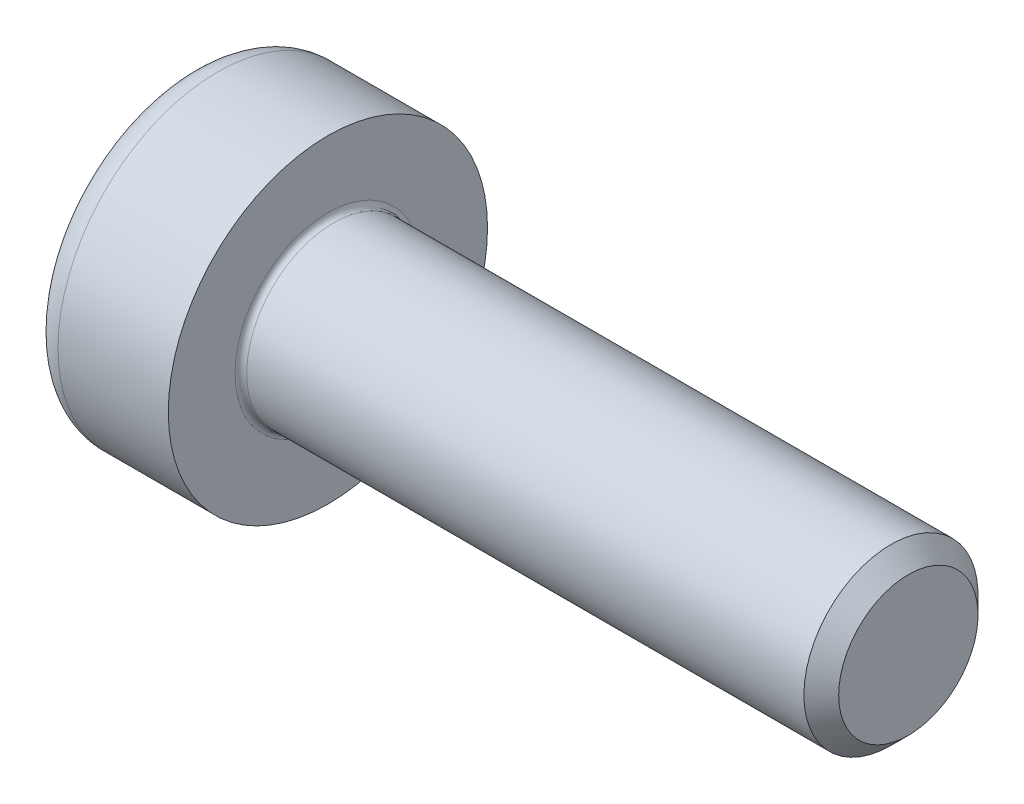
ISO-10303-21;
HEADER;
FILE_DESCRIPTION(('STEP AP214'),'2;1');
FILE_NAME('part.step','',(''),(''),'','','');
FILE_SCHEMA(('AUTOMOTIVE_DESIGN { 1 0 10303 214 1 1 1 1 }'));
ENDSEC;
DATA;
#1=APPLICATION_CONTEXT('core data for automotive mechanical design processes');
#2=APPLICATION_PROTOCOL_DEFINITION('international standard','automotive_design',2000,#1);
#3=PRODUCT_CONTEXT('',#1,'mechanical');
#4=PRODUCT('Part','Part','',(#3));
#5=PRODUCT_RELATED_PRODUCT_CATEGORY('part','',(#4));
#6=PRODUCT_DEFINITION_FORMATION('','',#4);
#7=PRODUCT_DEFINITION_CONTEXT('part definition',#1,'design');
#8=PRODUCT_DEFINITION('design','',#6,#7);
#9=PRODUCT_DEFINITION_SHAPE('','',#8);
#10=(LENGTH_UNIT() NAMED_UNIT(*) SI_UNIT(.MILLI.,.METRE.));
#11=(NAMED_UNIT(*) PLANE_ANGLE_UNIT() SI_UNIT($,.RADIAN.));
#12=(NAMED_UNIT(*) SI_UNIT($,.STERADIAN.) SOLID_ANGLE_UNIT());
#13=UNCERTAINTY_MEASURE_WITH_UNIT(LENGTH_MEASURE(1.E-05),#10,'distance_accuracy_value','');
#14=(GEOMETRIC_REPRESENTATION_CONTEXT(3) GLOBAL_UNCERTAINTY_ASSIGNED_CONTEXT((#13)) GLOBAL_UNIT_ASSIGNED_CONTEXT((#10,
#11,#12)) REPRESENTATION_CONTEXT('',''));
#15=CARTESIAN_POINT('',(0.,0.,0.));
#16=DIRECTION('',(0.,0.,1.));
#17=DIRECTION('',(1.,0.,0.));
#18=AXIS2_PLACEMENT_3D('',#15,#16,#17);
#19=CARTESIAN_POINT('',(1.30000000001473,0.,0.));
#20=DIRECTION('',(-1.,0.,0.));
#21=DIRECTION('',(0.,0.,1.));
#22=AXIS2_PLACEMENT_3D('',#19,#20,#21);
#23=CONICAL_SURFACE('',#22,1.26000000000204,1.0471975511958);
#24=CARTESIAN_POINT('',(2.0274613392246,0.,1.4210854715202E-10));
#25=VERTEX_POINT('',#24);
#26=VERTEX_LOOP('',#25);
#27=FACE_BOUND('',#26,.T.);
#28=CARTESIAN_POINT('',(1.30000000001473,0.,0.));
#29=DIRECTION('',(-1.,0.,0.));
#30=DIRECTION('',(0.,0.,1.));
#31=AXIS2_PLACEMENT_3D('',#28,#29,#30);
#32=CIRCLE('',#31,1.26000000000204);
#33=CARTESIAN_POINT('',(1.30000000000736,1.66379148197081E-13,1.26000000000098));
#34=VERTEX_POINT('',#33);
#35=CARTESIAN_POINT('',(1.30000000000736,-1.09119200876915,0.630000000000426));
#36=VERTEX_POINT('',#35);
#37=EDGE_CURVE('E165',#34,#36,#32,.F.);
#38=ORIENTED_EDGE('',*,*,#37,.F.);
#39=CARTESIAN_POINT('',(1.30000000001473,0.,0.));
#40=DIRECTION('',(-1.,0.,0.));
#41=DIRECTION('',(0.,0.,1.));
#42=AXIS2_PLACEMENT_3D('',#39,#40,#41);
#43=CIRCLE('',#42,1.26000000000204);
#44=CARTESIAN_POINT('',(1.30000000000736,1.09119200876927,0.630000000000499));
#45=VERTEX_POINT('',#44);
#46=EDGE_CURVE('E161',#45,#34,#43,.F.);
#47=ORIENTED_EDGE('',*,*,#46,.F.);
#48=CARTESIAN_POINT('',(1.30000000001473,0.,0.));
#49=DIRECTION('',(-1.,0.,0.));
#50=DIRECTION('',(0.,0.,1.));
#51=AXIS2_PLACEMENT_3D('',#48,#49,#50);
#52=CIRCLE('',#51,1.26000000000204);
#53=CARTESIAN_POINT('',(1.30000000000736,1.09119200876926,-0.630000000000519));
#54=VERTEX_POINT('',#53);
#55=EDGE_CURVE('E108',#54,#45,#52,.F.);
#56=ORIENTED_EDGE('',*,*,#55,.F.);
#57=CARTESIAN_POINT('',(1.30000000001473,0.,0.));
#58=DIRECTION('',(-1.,0.,0.));
#59=DIRECTION('',(0.,0.,1.));
#60=AXIS2_PLACEMENT_3D('',#57,#58,#59);
#61=CIRCLE('',#60,1.26000000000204);
#62=CARTESIAN_POINT('',(1.30000000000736,0.,-1.26000000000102));
#63=VERTEX_POINT('',#62);
#64=EDGE_CURVE('E102',#63,#54,#61,.F.);
#65=ORIENTED_EDGE('',*,*,#64,.F.);
#66=CARTESIAN_POINT('',(1.30000000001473,0.,0.));
#67=DIRECTION('',(-1.,0.,0.));
#68=DIRECTION('',(0.,0.,1.));
#69=AXIS2_PLACEMENT_3D('',#66,#67,#68);
#70=CIRCLE('',#69,1.26000000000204);
#71=CARTESIAN_POINT('',(1.30000000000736,-1.09119200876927,-0.630000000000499));
#72=VERTEX_POINT('',#71);
#73=EDGE_CURVE('E105',#72,#63,#70,.F.);
#74=ORIENTED_EDGE('',*,*,#73,.F.);
#75=CARTESIAN_POINT('',(1.30000000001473,0.,0.));
#76=DIRECTION('',(-1.,0.,0.));
#77=DIRECTION('',(0.,0.,1.));
#78=AXIS2_PLACEMENT_3D('',#75,#76,#77);
#79=CIRCLE('',#78,1.26000000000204);
#80=EDGE_CURVE('E130',#36,#72,#79,.F.);
#81=ORIENTED_EDGE('',*,*,#80,.F.);
#82=EDGE_LOOP('',(#38,#47,#56,#65,#74,#81));
#83=FACE_BOUND('',#82,.T.);
#84=ADVANCED_FACE('F17',(#27,#83),#23,.F.);
#85=CARTESIAN_POINT('',(1.3,0.727461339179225,1.25999999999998));
#86=DIRECTION('',(-1.,0.,0.));
#87=DIRECTION('',(0.,-1.,0.));
#88=AXIS2_PLACEMENT_3D('',#85,#86,#87);
#89=PLANE('',#88);
#90=DIRECTION('',(0.,0.500000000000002,0.866025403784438));
#91=VECTOR('',#90,1.);
#92=CARTESIAN_POINT('',(1.3,1.45492267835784,0.));
#93=LINE('',#92,#91);
#94=CARTESIAN_POINT('',(1.3,0.72746133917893,-1.26000000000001));
#95=VERTEX_POINT('',#94);
#96=EDGE_CURVE('E116',#54,#95,#93,.F.);
#97=ORIENTED_EDGE('',*,*,#96,.T.);
#98=DIRECTION('',(0.,1.,0.));
#99=VECTOR('',#98,1.);
#100=CARTESIAN_POINT('',(1.3,0.727461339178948,-1.26000000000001));
#101=LINE('',#100,#99);
#102=EDGE_CURVE('E114',#95,#63,#101,.F.);
#103=ORIENTED_EDGE('',*,*,#102,.T.);
#104=ORIENTED_EDGE('',*,*,#64,.T.);
#105=EDGE_LOOP('',(#97,#103,#104));
#106=FACE_BOUND('',#105,.T.);
#107=ADVANCED_FACE('F115',(#106),#89,.T.);
#108=CARTESIAN_POINT('',(1.3,0.727461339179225,1.25999999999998));
#109=DIRECTION('',(-1.,0.,0.));
#110=DIRECTION('',(0.,-1.,0.));
#111=AXIS2_PLACEMENT_3D('',#108,#109,#110);
#112=PLANE('',#111);
#113=DIRECTION('',(0.,1.,0.));
#114=VECTOR('',#113,1.);
#115=CARTESIAN_POINT('',(1.3,0.727461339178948,-1.26000000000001));
#116=LINE('',#115,#114);
#117=CARTESIAN_POINT('',(1.3,-0.727461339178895,-1.26000000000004));
#118=VERTEX_POINT('',#117);
#119=EDGE_CURVE('E121',#63,#118,#116,.F.);
#120=ORIENTED_EDGE('',*,*,#119,.T.);
#121=DIRECTION('',(0.,-0.499999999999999,0.866025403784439));
#122=VECTOR('',#121,1.);
#123=CARTESIAN_POINT('',(1.3,-1.45492267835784,0.));
#124=LINE('',#123,#122);
#125=EDGE_CURVE('E128',#72,#118,#124,.F.);
#126=ORIENTED_EDGE('',*,*,#125,.F.);
#127=ORIENTED_EDGE('',*,*,#73,.T.);
#128=EDGE_LOOP('',(#120,#126,#127));
#129=FACE_BOUND('',#128,.T.);
#130=ADVANCED_FACE('F125',(#129),#112,.T.);
#131=CARTESIAN_POINT('',(1.3,0.727461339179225,1.25999999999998));
#132=DIRECTION('',(-1.,0.,0.));
#133=DIRECTION('',(0.,-1.,0.));
#134=AXIS2_PLACEMENT_3D('',#131,#132,#133);
#135=PLANE('',#134);
#136=DIRECTION('',(0.,-0.499999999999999,0.866025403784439));
#137=VECTOR('',#136,1.);
#138=CARTESIAN_POINT('',(1.3,-1.45492267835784,0.));
#139=LINE('',#138,#137);
#140=CARTESIAN_POINT('',(1.3,-1.45492267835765,-1.33223180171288E-13));
#141=VERTEX_POINT('',#140);
#142=EDGE_CURVE('E137',#141,#72,#139,.F.);
#143=ORIENTED_EDGE('',*,*,#142,.F.);
#144=DIRECTION('',(0.,0.500000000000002,0.866025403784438));
#145=VECTOR('',#144,1.);
#146=CARTESIAN_POINT('',(1.3,-0.727461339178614,1.25999999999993));
#147=LINE('',#146,#145);
#148=EDGE_CURVE('E305',#36,#141,#147,.F.);
#149=ORIENTED_EDGE('',*,*,#148,.F.);
#150=ORIENTED_EDGE('',*,*,#80,.T.);
#151=EDGE_LOOP('',(#143,#149,#150));
#152=FACE_BOUND('',#151,.T.);
#153=ADVANCED_FACE('F502',(#152),#135,.T.);
#154=CARTESIAN_POINT('',(1.3,0.727461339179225,1.25999999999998));
#155=DIRECTION('',(-1.,0.,0.));
#156=DIRECTION('',(0.,-1.,0.));
#157=AXIS2_PLACEMENT_3D('',#154,#155,#156);
#158=PLANE('',#157);
#159=DIRECTION('',(0.,0.500000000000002,0.866025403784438));
#160=VECTOR('',#159,1.);
#161=CARTESIAN_POINT('',(1.3,-0.727461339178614,1.25999999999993));
#162=LINE('',#161,#160);
#163=CARTESIAN_POINT('',(1.3,-0.727461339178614,1.25999999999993));
#164=VERTEX_POINT('',#163);
#165=EDGE_CURVE('E302',#164,#36,#162,.F.);
#166=ORIENTED_EDGE('',*,*,#165,.F.);
#167=DIRECTION('',(0.,-1.,0.));
#168=VECTOR('',#167,1.);
#169=CARTESIAN_POINT('',(1.3,-0.727461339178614,1.25999999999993));
#170=LINE('',#169,#168);
#171=EDGE_CURVE('E272',#164,#34,#170,.F.);
#172=ORIENTED_EDGE('',*,*,#171,.T.);
#173=ORIENTED_EDGE('',*,*,#37,.T.);
#174=EDGE_LOOP('',(#166,#172,#173));
#175=FACE_BOUND('',#174,.T.);
#176=ADVANCED_FACE('F493',(#175),#158,.T.);
#177=CARTESIAN_POINT('',(1.3,0.727461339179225,1.25999999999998));
#178=DIRECTION('',(-1.,0.,0.));
#179=DIRECTION('',(0.,-1.,0.));
#180=AXIS2_PLACEMENT_3D('',#177,#178,#179);
#181=PLANE('',#180);
#182=DIRECTION('',(0.,0.499999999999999,-0.866025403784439));
#183=VECTOR('',#182,1.);
#184=CARTESIAN_POINT('',(1.3,1.45492267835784,0.));
#185=LINE('',#184,#183);
#186=CARTESIAN_POINT('',(1.3,1.45492267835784,0.));
#187=VERTEX_POINT('',#186);
#188=EDGE_CURVE('E247',#187,#45,#185,.F.);
#189=ORIENTED_EDGE('',*,*,#188,.F.);
#190=DIRECTION('',(0.,0.500000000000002,0.866025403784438));
#191=VECTOR('',#190,1.);
#192=CARTESIAN_POINT('',(1.3,1.45492267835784,0.));
#193=LINE('',#192,#191);
#194=EDGE_CURVE('E150',#187,#54,#193,.F.);
#195=ORIENTED_EDGE('',*,*,#194,.T.);
#196=ORIENTED_EDGE('',*,*,#55,.T.);
#197=EDGE_LOOP('',(#189,#195,#196));
#198=FACE_BOUND('',#197,.T.);
#199=ADVANCED_FACE('F484',(#198),#181,.T.);
#200=CARTESIAN_POINT('',(1.3,0.727461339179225,1.25999999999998));
#201=DIRECTION('',(-1.,0.,0.));
#202=DIRECTION('',(0.,-1.,0.));
#203=AXIS2_PLACEMENT_3D('',#200,#201,#202);
#204=PLANE('',#203);
#205=DIRECTION('',(0.,-1.,0.));
#206=VECTOR('',#205,1.);
#207=CARTESIAN_POINT('',(1.3,-0.727461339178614,1.25999999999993));
#208=LINE('',#207,#206);
#209=CARTESIAN_POINT('',(1.3,0.72746133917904,1.25999999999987));
#210=VERTEX_POINT('',#209);
#211=EDGE_CURVE('E269',#34,#210,#208,.F.);
#212=ORIENTED_EDGE('',*,*,#211,.T.);
#213=DIRECTION('',(0.,0.499999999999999,-0.866025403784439));
#214=VECTOR('',#213,1.);
#215=CARTESIAN_POINT('',(1.3,1.45492267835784,0.));
#216=LINE('',#215,#214);
#217=EDGE_CURVE('E255',#45,#210,#216,.F.);
#218=ORIENTED_EDGE('',*,*,#217,.F.);
#219=ORIENTED_EDGE('',*,*,#46,.T.);
#220=EDGE_LOOP('',(#212,#218,#219));
#221=FACE_BOUND('',#220,.T.);
#222=ADVANCED_FACE('F475',(#221),#204,.T.);
#223=CARTESIAN_POINT('',(1.3,1.45492267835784,0.));
#224=DIRECTION('',(0.,0.866025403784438,-0.500000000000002));
#225=DIRECTION('',(0.,0.500000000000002,0.866025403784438));
#226=AXIS2_PLACEMENT_3D('',#223,#224,#225);
#227=PLANE('',#226);
#228=DIRECTION('',(0.,-0.499999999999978,-0.866025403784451));
#229=VECTOR('',#228,1.);
#230=CARTESIAN_POINT('',(0.599999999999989,1.45492267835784,0.));
#231=LINE('',#230,#229);
#232=CARTESIAN_POINT('',(0.599999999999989,1.45492267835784,0.));
#233=VERTEX_POINT('',#232);
#234=CARTESIAN_POINT('',(0.599999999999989,0.72746133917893,-1.26));
#235=VERTEX_POINT('',#234);
#236=EDGE_CURVE('E266',#233,#235,#231,.T.);
#237=ORIENTED_EDGE('',*,*,#236,.T.);
#238=DIRECTION('',(1.,0.,0.));
#239=VECTOR('',#238,1.);
#240=CARTESIAN_POINT('',(1.3,0.727461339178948,-1.26000000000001));
#241=LINE('',#240,#239);
#242=EDGE_CURVE('E135',#235,#95,#241,.T.);
#243=ORIENTED_EDGE('',*,*,#242,.T.);
#244=ORIENTED_EDGE('',*,*,#96,.F.);
#245=ORIENTED_EDGE('',*,*,#194,.F.);
#246=DIRECTION('',(1.,0.,0.));
#247=VECTOR('',#246,1.);
#248=CARTESIAN_POINT('',(1.3,1.45492267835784,0.));
#249=LINE('',#248,#247);
#250=EDGE_CURVE('E256',#233,#187,#249,.T.);
#251=ORIENTED_EDGE('',*,*,#250,.F.);
#252=EDGE_LOOP('',(#237,#243,#244,#245,#251));
#253=FACE_BOUND('',#252,.T.);
#254=ADVANCED_FACE('F467',(#253),#227,.F.);
#255=CARTESIAN_POINT('',(1.3,0.727461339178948,-1.26000000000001));
#256=DIRECTION('',(0.,0.,-1.));
#257=DIRECTION('',(0.,1.,0.));
#258=AXIS2_PLACEMENT_3D('',#255,#256,#257);
#259=PLANE('',#258);
#260=DIRECTION('',(0.,1.,0.));
#261=VECTOR('',#260,1.);
#262=CARTESIAN_POINT('',(0.599999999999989,2.74999999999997,-1.26000000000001));
#263=LINE('',#262,#261);
#264=CARTESIAN_POINT('',(0.599999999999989,-0.727461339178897,-1.26000000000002));
#265=VERTEX_POINT('',#264);
#266=EDGE_CURVE('E290',#235,#265,#263,.F.);
#267=ORIENTED_EDGE('',*,*,#266,.T.);
#268=DIRECTION('',(1.,0.,0.));
#269=VECTOR('',#268,1.);
#270=CARTESIAN_POINT('',(1.3,-0.727461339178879,-1.26000000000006));
#271=LINE('',#270,#269);
#272=EDGE_CURVE('E134',#118,#265,#271,.F.);
#273=ORIENTED_EDGE('',*,*,#272,.F.);
#274=ORIENTED_EDGE('',*,*,#119,.F.);
#275=ORIENTED_EDGE('',*,*,#102,.F.);
#276=ORIENTED_EDGE('',*,*,#242,.F.);
#277=EDGE_LOOP('',(#267,#273,#274,#275,#276));
#278=FACE_BOUND('',#277,.T.);
#279=ADVANCED_FACE('F132',(#278),#259,.F.);
#280=CARTESIAN_POINT('',(1.3,-1.45492267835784,0.));
#281=DIRECTION('',(0.,0.866025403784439,0.499999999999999));
#282=DIRECTION('',(0.,-0.499999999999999,0.866025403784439));
#283=AXIS2_PLACEMENT_3D('',#280,#281,#282);
#284=PLANE('',#283);
#285=ORIENTED_EDGE('',*,*,#125,.T.);
#286=ORIENTED_EDGE('',*,*,#272,.T.);
#287=DIRECTION('',(0.,-0.49999999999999,0.866025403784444));
#288=VECTOR('',#287,1.);
#289=CARTESIAN_POINT('',(0.599999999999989,-0.727461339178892,-1.26000000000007));
#290=LINE('',#289,#288);
#291=CARTESIAN_POINT('',(0.599999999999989,-1.45492267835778,0.));
#292=VERTEX_POINT('',#291);
#293=EDGE_CURVE('E325',#265,#292,#290,.T.);
#294=ORIENTED_EDGE('',*,*,#293,.T.);
#295=DIRECTION('',(1.,0.,0.));
#296=VECTOR('',#295,1.);
#297=CARTESIAN_POINT('',(1.3,-1.45492267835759,-1.45499931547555E-13));
#298=LINE('',#297,#296);
#299=EDGE_CURVE('E295',#141,#292,#298,.F.);
#300=ORIENTED_EDGE('',*,*,#299,.F.);
#301=ORIENTED_EDGE('',*,*,#142,.T.);
#302=EDGE_LOOP('',(#285,#286,#294,#300,#301));
#303=FACE_BOUND('',#302,.T.);
#304=ADVANCED_FACE('F323',(#303),#284,.T.);
#305=CARTESIAN_POINT('',(1.3,-0.727461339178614,1.25999999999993));
#306=DIRECTION('',(0.,0.866025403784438,-0.500000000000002));
#307=DIRECTION('',(0.,0.500000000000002,0.866025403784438));
#308=AXIS2_PLACEMENT_3D('',#305,#306,#307);
#309=PLANE('',#308);
#310=ORIENTED_EDGE('',*,*,#148,.T.);
#311=ORIENTED_EDGE('',*,*,#299,.T.);
#312=DIRECTION('',(0.,0.500000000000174,0.866025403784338));
#313=VECTOR('',#312,1.);
#314=CARTESIAN_POINT('',(0.599999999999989,-1.45492267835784,0.));
#315=LINE('',#314,#313);
#316=CARTESIAN_POINT('',(0.599999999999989,-0.727461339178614,1.25999999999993));
#317=VERTEX_POINT('',#316);
#318=EDGE_CURVE('E332',#292,#317,#315,.T.);
#319=ORIENTED_EDGE('',*,*,#318,.T.);
#320=DIRECTION('',(1.,0.,0.));
#321=VECTOR('',#320,1.);
#322=CARTESIAN_POINT('',(1.3,-0.727461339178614,1.25999999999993));
#323=LINE('',#322,#321);
#324=EDGE_CURVE('E271',#317,#164,#323,.T.);
#325=ORIENTED_EDGE('',*,*,#324,.T.);
#326=ORIENTED_EDGE('',*,*,#165,.T.);
#327=EDGE_LOOP('',(#310,#311,#319,#325,#326));
#328=FACE_BOUND('',#327,.T.);
#329=ADVANCED_FACE('F443',(#328),#309,.T.);
#330=CARTESIAN_POINT('',(1.3,-0.727461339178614,1.25999999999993));
#331=DIRECTION('',(0.,0.,1.));
#332=DIRECTION('',(0.,-1.,0.));
#333=AXIS2_PLACEMENT_3D('',#330,#331,#332);
#334=PLANE('',#333);
#335=DIRECTION('',(0.,1.,0.));
#336=VECTOR('',#335,1.);
#337=CARTESIAN_POINT('',(0.599999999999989,2.74999999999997,1.25999999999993));
#338=LINE('',#337,#336);
#339=CARTESIAN_POINT('',(0.599999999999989,0.727461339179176,1.25999999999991));
#340=VERTEX_POINT('',#339);
#341=EDGE_CURVE('E286',#317,#340,#338,.T.);
#342=ORIENTED_EDGE('',*,*,#341,.T.);
#343=DIRECTION('',(1.,0.,0.));
#344=VECTOR('',#343,1.);
#345=CARTESIAN_POINT('',(1.3,0.727461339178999,1.25999999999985));
#346=LINE('',#345,#344);
#347=EDGE_CURVE('E261',#210,#340,#346,.F.);
#348=ORIENTED_EDGE('',*,*,#347,.F.);
#349=ORIENTED_EDGE('',*,*,#211,.F.);
#350=ORIENTED_EDGE('',*,*,#171,.F.);
#351=ORIENTED_EDGE('',*,*,#324,.F.);
#352=EDGE_LOOP('',(#342,#348,#349,#350,#351));
#353=FACE_BOUND('',#352,.T.);
#354=ADVANCED_FACE('F435',(#353),#334,.F.);
#355=CARTESIAN_POINT('',(1.3,1.45492267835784,0.));
#356=DIRECTION('',(0.,-0.866025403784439,-0.499999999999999));
#357=DIRECTION('',(0.,0.499999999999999,-0.866025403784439));
#358=AXIS2_PLACEMENT_3D('',#355,#356,#357);
#359=PLANE('',#358);
#360=ORIENTED_EDGE('',*,*,#217,.T.);
#361=ORIENTED_EDGE('',*,*,#347,.T.);
#362=DIRECTION('',(0.,0.499999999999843,-0.866025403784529));
#363=VECTOR('',#362,1.);
#364=CARTESIAN_POINT('',(0.599999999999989,0.727461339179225,1.25999999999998));
#365=LINE('',#364,#363);
#366=EDGE_CURVE('E282',#340,#233,#365,.T.);
#367=ORIENTED_EDGE('',*,*,#366,.T.);
#368=ORIENTED_EDGE('',*,*,#250,.T.);
#369=ORIENTED_EDGE('',*,*,#188,.T.);
#370=EDGE_LOOP('',(#360,#361,#367,#368,#369));
#371=FACE_BOUND('',#370,.T.);
#372=ADVANCED_FACE('F428',(#371),#359,.T.);
#373=CARTESIAN_POINT('',(0.599999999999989,2.74999999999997,0.));
#374=DIRECTION('',(1.,0.,0.));
#375=DIRECTION('',(0.,1.,0.));
#376=AXIS2_PLACEMENT_3D('',#373,#374,#375);
#377=PLANE('',#376);
#378=ORIENTED_EDGE('',*,*,#341,.F.);
#379=ORIENTED_EDGE('',*,*,#318,.F.);
#380=ORIENTED_EDGE('',*,*,#293,.F.);
#381=ORIENTED_EDGE('',*,*,#266,.F.);
#382=ORIENTED_EDGE('',*,*,#236,.F.);
#383=ORIENTED_EDGE('',*,*,#366,.F.);
#384=EDGE_LOOP('',(#378,#379,#380,#381,#382,#383));
#385=FACE_BOUND('',#384,.T.);
#386=CARTESIAN_POINT('',(0.59999999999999,0.,0.));
#387=DIRECTION('',(1.,0.,0.));
#388=DIRECTION('',(0.,0.,-1.));
#389=AXIS2_PLACEMENT_3D('',#386,#387,#388);
#390=CIRCLE('',#389,2.25);
#391=CARTESIAN_POINT('',(0.59999999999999,0.,-2.25));
#392=VERTEX_POINT('',#391);
#393=CARTESIAN_POINT('',(0.59999999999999,0.,2.25));
#394=VERTEX_POINT('',#393);
#395=EDGE_CURVE('E285',#392,#394,#390,.T.);
#396=ORIENTED_EDGE('',*,*,#395,.F.);
#397=CARTESIAN_POINT('',(0.59999999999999,0.,0.));
#398=DIRECTION('',(1.,0.,0.));
#399=DIRECTION('',(0.,0.,1.));
#400=AXIS2_PLACEMENT_3D('',#397,#398,#399);
#401=CIRCLE('',#400,2.25);
#402=EDGE_CURVE('E347',#394,#392,#401,.T.);
#403=ORIENTED_EDGE('',*,*,#402,.F.);
#404=EDGE_LOOP('',(#396,#403));
#405=FACE_BOUND('',#404,.T.);
#406=ADVANCED_FACE('F235',(#385,#405),#377,.F.);
#407=CARTESIAN_POINT('',(1.09999999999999,0.,0.));
#408=DIRECTION('',(1.,0.,0.));
#409=DIRECTION('',(0.,0.,-1.));
#410=AXIS2_PLACEMENT_3D('',#407,#408,#409);
#411=TOROIDAL_SURFACE('',#410,2.25,0.5);
#412=ORIENTED_EDGE('',*,*,#395,.T.);
#413=ORIENTED_EDGE('',*,*,#402,.T.);
#414=EDGE_LOOP('',(#412,#413));
#415=FACE_BOUND('',#414,.T.);
#416=CARTESIAN_POINT('',(1.09999999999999,0.,0.));
#417=DIRECTION('',(-1.,0.,0.));
#418=DIRECTION('',(0.,-1.,0.));
#419=AXIS2_PLACEMENT_3D('',#416,#417,#418);
#420=CIRCLE('',#419,2.75);
#421=CARTESIAN_POINT('',(1.09999999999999,-2.75,0.));
#422=VERTEX_POINT('',#421);
#423=EDGE_CURVE('E160',#422,#422,#420,.F.);
#424=ORIENTED_EDGE('',*,*,#423,.F.);
#425=EDGE_LOOP('',(#424));
#426=FACE_BOUND('',#425,.T.);
#427=ADVANCED_FACE('F230',(#415,#426),#411,.T.);
#428=CARTESIAN_POINT('',(-31.7499999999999,0.,0.));
#429=DIRECTION('',(-1.,0.,0.));
#430=DIRECTION('',(0.,-1.,0.));
#431=AXIS2_PLACEMENT_3D('',#428,#429,#430);
#432=CYLINDRICAL_SURFACE('',#431,2.75);
#433=CARTESIAN_POINT('',(3.,0.,0.));
#434=DIRECTION('',(-1.,0.,0.));
#435=DIRECTION('',(0.,-1.,0.));
#436=AXIS2_PLACEMENT_3D('',#433,#434,#435);
#437=CIRCLE('',#436,2.75);
#438=CARTESIAN_POINT('',(3.,-2.75,0.));
#439=VERTEX_POINT('',#438);
#440=EDGE_CURVE('E157',#439,#439,#437,.F.);
#441=ORIENTED_EDGE('',*,*,#440,.F.);
#442=EDGE_LOOP('',(#441));
#443=FACE_BOUND('',#442,.T.);
#444=ORIENTED_EDGE('',*,*,#423,.T.);
#445=EDGE_LOOP('',(#444));
#446=FACE_BOUND('',#445,.T.);
#447=ADVANCED_FACE('F234',(#443,#446),#432,.T.);
#448=CARTESIAN_POINT('',(13.,2.74999999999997,0.));
#449=DIRECTION('',(1.,0.,0.));
#450=DIRECTION('',(0.,1.,0.));
#451=AXIS2_PLACEMENT_3D('',#448,#449,#450);
#452=PLANE('',#451);
#453=CARTESIAN_POINT('',(12.9999999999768,0.,0.));
#454=DIRECTION('',(-1.,0.,0.));
#455=DIRECTION('',(0.,0.,1.));
#456=AXIS2_PLACEMENT_3D('',#453,#454,#455);
#457=CIRCLE('',#456,1.20000000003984);
#458=CARTESIAN_POINT('',(12.9999999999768,0.,1.20000000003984));
#459=VERTEX_POINT('',#458);
#460=EDGE_CURVE('E153',#459,#459,#457,.T.);
#461=ORIENTED_EDGE('',*,*,#460,.F.);
#462=EDGE_LOOP('',(#461));
#463=FACE_BOUND('',#462,.T.);
#464=ADVANCED_FACE('F207',(#463),#452,.T.);
#465=CARTESIAN_POINT('',(3.,2.74999999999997,0.));
#466=DIRECTION('',(1.,0.,0.));
#467=DIRECTION('',(0.,1.,0.));
#468=AXIS2_PLACEMENT_3D('',#465,#466,#467);
#469=PLANE('',#468);
#470=ORIENTED_EDGE('',*,*,#440,.T.);
#471=EDGE_LOOP('',(#470));
#472=FACE_BOUND('',#471,.T.);
#473=CARTESIAN_POINT('',(2.99999999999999,0.,0.));
#474=DIRECTION('',(1.,0.,0.));
#475=DIRECTION('',(0.,0.,1.));
#476=AXIS2_PLACEMENT_3D('',#473,#474,#475);
#477=CIRCLE('',#476,1.59999999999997);
#478=CARTESIAN_POINT('',(3.,0.,-1.59999999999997));
#479=VERTEX_POINT('',#478);
#480=CARTESIAN_POINT('',(3.,0.,1.59999999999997));
#481=VERTEX_POINT('',#480);
#482=EDGE_CURVE('E156',#479,#481,#477,.F.);
#483=ORIENTED_EDGE('',*,*,#482,.T.);
#484=CARTESIAN_POINT('',(2.99999999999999,0.,0.));
#485=DIRECTION('',(1.,0.,0.));
#486=DIRECTION('',(0.,0.,-1.));
#487=AXIS2_PLACEMENT_3D('',#484,#485,#486);
#488=CIRCLE('',#487,1.59999999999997);
#489=EDGE_CURVE('E36',#481,#479,#488,.F.);
#490=ORIENTED_EDGE('',*,*,#489,.T.);
#491=EDGE_LOOP('',(#483,#490));
#492=FACE_BOUND('',#491,.T.);
#493=ADVANCED_FACE('F198',(#472,#492),#469,.T.);
#494=CARTESIAN_POINT('',(12.7000000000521,0.,0.));
#495=DIRECTION('',(-1.,0.,0.));
#496=DIRECTION('',(0.,0.,1.));
#497=AXIS2_PLACEMENT_3D('',#494,#495,#496);
#498=CONICAL_SURFACE('',#497,1.50000000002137,0.785398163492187);
#499=CARTESIAN_POINT('',(12.7,0.,0.));
#500=DIRECTION('',(-1.,0.,0.));
#501=DIRECTION('',(0.,-1.,0.));
#502=AXIS2_PLACEMENT_3D('',#499,#500,#501);
#503=CIRCLE('',#502,1.49999999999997);
#504=CARTESIAN_POINT('',(12.7,-1.49999999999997,0.));
#505=VERTEX_POINT('',#504);
#506=EDGE_CURVE('E28',#505,#505,#503,.T.);
#507=ORIENTED_EDGE('',*,*,#506,.F.);
#508=EDGE_LOOP('',(#507));
#509=FACE_BOUND('',#508,.T.);
#510=ORIENTED_EDGE('',*,*,#460,.T.);
#511=EDGE_LOOP('',(#510));
#512=FACE_BOUND('',#511,.T.);
#513=ADVANCED_FACE('F186',(#509,#512),#498,.T.);
#514=CARTESIAN_POINT('',(3.09999999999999,0.,0.));
#515=DIRECTION('',(1.,0.,0.));
#516=DIRECTION('',(0.,0.,-1.));
#517=AXIS2_PLACEMENT_3D('',#514,#515,#516);
#518=TOROIDAL_SURFACE('',#517,1.59999999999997,0.1);
#519=CARTESIAN_POINT('',(3.09999999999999,0.,0.));
#520=DIRECTION('',(-1.,0.,0.));
#521=DIRECTION('',(0.,-1.,0.));
#522=AXIS2_PLACEMENT_3D('',#519,#520,#521);
#523=CIRCLE('',#522,1.49999999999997);
#524=CARTESIAN_POINT('',(3.09999999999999,-1.49999999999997,0.));
#525=VERTEX_POINT('',#524);
#526=EDGE_CURVE('E11',#525,#525,#523,.F.);
#527=ORIENTED_EDGE('',*,*,#526,.F.);
#528=EDGE_LOOP('',(#527));
#529=FACE_BOUND('',#528,.T.);
#530=ORIENTED_EDGE('',*,*,#482,.F.);
#531=ORIENTED_EDGE('',*,*,#489,.F.);
#532=EDGE_LOOP('',(#530,#531));
#533=FACE_BOUND('',#532,.T.);
#534=ADVANCED_FACE('F174',(#529,#533),#518,.F.);
#535=CARTESIAN_POINT('',(-31.7499999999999,0.,0.));
#536=DIRECTION('',(-1.,0.,0.));
#537=DIRECTION('',(0.,-1.,0.));
#538=AXIS2_PLACEMENT_3D('',#535,#536,#537);
#539=CYLINDRICAL_SURFACE('',#538,1.49999999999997);
#540=ORIENTED_EDGE('',*,*,#526,.T.);
#541=EDGE_LOOP('',(#540));
#542=FACE_BOUND('',#541,.T.);
#543=ORIENTED_EDGE('',*,*,#506,.T.);
#544=EDGE_LOOP('',(#543));
#545=FACE_BOUND('',#544,.T.);
#546=ADVANCED_FACE('F185',(#542,#545),#539,.T.);
#547=CLOSED_SHELL('',(#84,#107,#130,#153,#176,#199,#222,#254,#279,#304,#329,#354,#372,#406,#427,
#447,#464,#493,#513,#534,#546));
#548=MANIFOLD_SOLID_BREP('B1',#547);
#549=ADVANCED_BREP_SHAPE_REPRESENTATION('',(#18,#548),#14);
#550=SHAPE_DEFINITION_REPRESENTATION(#9,#549);
ENDSEC;
END-ISO-10303-21;
